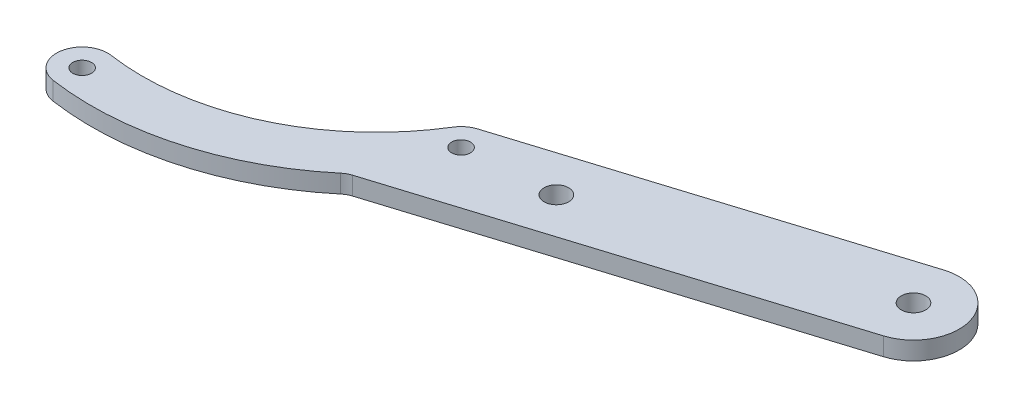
ISO-10303-21;
HEADER;
FILE_DESCRIPTION(('STEP AP214'),'2;1');
FILE_NAME('part.step','',(''),(''),'','','');
FILE_SCHEMA(('AUTOMOTIVE_DESIGN { 1 0 10303 214 1 1 1 1 }'));
ENDSEC;
DATA;
#1=APPLICATION_CONTEXT('core data for automotive mechanical design processes');
#2=APPLICATION_PROTOCOL_DEFINITION('international standard','automotive_design',2000,#1);
#3=PRODUCT_CONTEXT('',#1,'mechanical');
#4=PRODUCT('Part','Part','',(#3));
#5=PRODUCT_RELATED_PRODUCT_CATEGORY('part','',(#4));
#6=PRODUCT_DEFINITION_FORMATION('','',#4);
#7=PRODUCT_DEFINITION_CONTEXT('part definition',#1,'design');
#8=PRODUCT_DEFINITION('design','',#6,#7);
#9=PRODUCT_DEFINITION_SHAPE('','',#8);
#10=(LENGTH_UNIT() NAMED_UNIT(*) SI_UNIT(.MILLI.,.METRE.));
#11=(NAMED_UNIT(*) PLANE_ANGLE_UNIT() SI_UNIT($,.RADIAN.));
#12=(NAMED_UNIT(*) SI_UNIT($,.STERADIAN.) SOLID_ANGLE_UNIT());
#13=UNCERTAINTY_MEASURE_WITH_UNIT(LENGTH_MEASURE(1.E-05),#10,'distance_accuracy_value','');
#14=(GEOMETRIC_REPRESENTATION_CONTEXT(3) GLOBAL_UNCERTAINTY_ASSIGNED_CONTEXT((#13)) GLOBAL_UNIT_ASSIGNED_CONTEXT((#10,
#11,#12)) REPRESENTATION_CONTEXT('',''));
#15=CARTESIAN_POINT('',(0.,0.,0.));
#16=DIRECTION('',(0.,0.,1.));
#17=DIRECTION('',(1.,0.,0.));
#18=AXIS2_PLACEMENT_3D('',#15,#16,#17);
#19=CARTESIAN_POINT('',(-25.0100533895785,0.,7.80623016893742));
#20=DIRECTION('',(0.,-1.,0.));
#21=DIRECTION('',(0.,0.,-1.));
#22=AXIS2_PLACEMENT_3D('',#19,#20,#21);
#23=CYLINDRICAL_SURFACE('',#22,7.99999999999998);
#24=DIRECTION('',(0.,1.,0.));
#25=VECTOR('',#24,1.);
#26=CARTESIAN_POINT('',(-22.6264716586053,0.,15.4428876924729));
#27=LINE('',#26,#25);
#28=CARTESIAN_POINT('',(-22.6264716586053,0.,15.4428876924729));
#29=VERTEX_POINT('',#28);
#30=CARTESIAN_POINT('',(-22.6264716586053,3.175,15.4428876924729));
#31=VERTEX_POINT('',#30);
#32=EDGE_CURVE('E134',#29,#31,#27,.T.);
#33=ORIENTED_EDGE('',*,*,#32,.F.);
#34=CARTESIAN_POINT('',(-25.0100533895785,0.,7.80623016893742));
#35=DIRECTION('',(0.,1.,0.));
#36=DIRECTION('',(0.,0.,1.));
#37=AXIS2_PLACEMENT_3D('',#34,#35,#36);
#38=CIRCLE('',#37,7.99999999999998);
#39=CARTESIAN_POINT('',(-27.3936351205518,0.,0.169572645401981));
#40=VERTEX_POINT('',#39);
#41=EDGE_CURVE('E54',#40,#29,#38,.F.);
#42=ORIENTED_EDGE('',*,*,#41,.F.);
#43=DIRECTION('',(0.,-1.,0.));
#44=VECTOR('',#43,1.);
#45=CARTESIAN_POINT('',(-27.3936351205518,3.175,0.169572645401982));
#46=LINE('',#45,#44);
#47=CARTESIAN_POINT('',(-27.3936351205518,3.175,0.169572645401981));
#48=VERTEX_POINT('',#47);
#49=EDGE_CURVE('E137',#48,#40,#46,.T.);
#50=ORIENTED_EDGE('',*,*,#49,.F.);
#51=CARTESIAN_POINT('',(-25.0100533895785,3.175,7.80623016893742));
#52=DIRECTION('',(0.,1.,0.));
#53=DIRECTION('',(0.,0.,1.));
#54=AXIS2_PLACEMENT_3D('',#51,#52,#53);
#55=CIRCLE('',#54,7.99999999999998);
#56=EDGE_CURVE('E11',#31,#48,#55,.T.);
#57=ORIENTED_EDGE('',*,*,#56,.F.);
#58=EDGE_LOOP('',(#33,#42,#50,#57));
#59=FACE_BOUND('',#58,.T.);
#60=ADVANCED_FACE('F46',(#59),#23,.T.);
#61=CARTESIAN_POINT('',(-127.,3.175,0.));
#62=DIRECTION('',(0.,-1.,0.));
#63=DIRECTION('',(0.,0.,-1.));
#64=AXIS2_PLACEMENT_3D('',#61,#62,#63);
#65=CYLINDRICAL_SURFACE('',#64,49.9725233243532);
#66=CARTESIAN_POINT('',(-127.,0.,0.));
#67=DIRECTION('',(0.,1.,0.));
#68=DIRECTION('',(0.,0.,1.));
#69=AXIS2_PLACEMENT_3D('',#66,#67,#68);
#70=CIRCLE('',#69,49.9725233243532);
#71=CARTESIAN_POINT('',(-134.248974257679,0.,49.4439628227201));
#72=VERTEX_POINT('',#71);
#73=CARTESIAN_POINT('',(-94.9431782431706,0.,38.3355352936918));
#74=VERTEX_POINT('',#73);
#75=EDGE_CURVE('E133',#72,#74,#70,.T.);
#76=ORIENTED_EDGE('',*,*,#75,.T.);
#77=DIRECTION('',(0.,-1.,0.));
#78=VECTOR('',#77,1.);
#79=CARTESIAN_POINT('',(-94.9431782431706,3.175,38.3355352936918));
#80=LINE('',#79,#78);
#81=CARTESIAN_POINT('',(-94.9431782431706,3.175,38.3355352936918));
#82=VERTEX_POINT('',#81);
#83=EDGE_CURVE('E113',#82,#74,#80,.T.);
#84=ORIENTED_EDGE('',*,*,#83,.F.);
#85=CARTESIAN_POINT('',(-127.,3.175,0.));
#86=DIRECTION('',(0.,1.,0.));
#87=DIRECTION('',(0.,0.,1.));
#88=AXIS2_PLACEMENT_3D('',#85,#86,#87);
#89=CIRCLE('',#88,49.9725233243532);
#90=CARTESIAN_POINT('',(-134.248974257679,3.175,49.4439628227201));
#91=VERTEX_POINT('',#90);
#92=EDGE_CURVE('E119',#91,#82,#89,.T.);
#93=ORIENTED_EDGE('',*,*,#92,.F.);
#94=DIRECTION('',(0.,-1.,0.));
#95=VECTOR('',#94,1.);
#96=CARTESIAN_POINT('',(-134.248974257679,3.175,49.4439628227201));
#97=LINE('',#96,#95);
#98=EDGE_CURVE('E167',#91,#72,#97,.T.);
#99=ORIENTED_EDGE('',*,*,#98,.T.);
#100=EDGE_LOOP('',(#76,#84,#93,#99));
#101=FACE_BOUND('',#100,.T.);
#102=ADVANCED_FACE('F131',(#101),#65,.T.);
#103=CARTESIAN_POINT('',(-92.3772224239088,3.175,41.4040643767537));
#104=DIRECTION('',(0.,-1.,0.));
#105=DIRECTION('',(0.,0.,-1.));
#106=AXIS2_PLACEMENT_3D('',#103,#104,#105);
#107=CYLINDRICAL_SURFACE('',#106,3.99999999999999);
#108=CARTESIAN_POINT('',(-92.3772224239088,0.,41.4040643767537));
#109=DIRECTION('',(0.,1.,0.));
#110=DIRECTION('',(0.,0.,1.));
#111=AXIS2_PLACEMENT_3D('',#108,#109,#110);
#112=CIRCLE('',#111,3.99999999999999);
#113=CARTESIAN_POINT('',(-93.5690132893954,0.,37.585735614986));
#114=VERTEX_POINT('',#113);
#115=EDGE_CURVE('E154',#74,#114,#112,.F.);
#116=ORIENTED_EDGE('',*,*,#115,.T.);
#117=DIRECTION('',(0.,-1.,0.));
#118=VECTOR('',#117,1.);
#119=CARTESIAN_POINT('',(-93.5690132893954,3.175,37.585735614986));
#120=LINE('',#119,#118);
#121=CARTESIAN_POINT('',(-93.5690132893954,3.175,37.585735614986));
#122=VERTEX_POINT('',#121);
#123=EDGE_CURVE('E116',#122,#114,#120,.T.);
#124=ORIENTED_EDGE('',*,*,#123,.F.);
#125=CARTESIAN_POINT('',(-92.3772224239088,3.175,41.4040643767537));
#126=DIRECTION('',(0.,1.,0.));
#127=DIRECTION('',(0.,0.,1.));
#128=AXIS2_PLACEMENT_3D('',#125,#126,#127);
#129=CIRCLE('',#128,3.99999999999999);
#130=EDGE_CURVE('E109',#82,#122,#129,.F.);
#131=ORIENTED_EDGE('',*,*,#130,.F.);
#132=ORIENTED_EDGE('',*,*,#83,.T.);
#133=EDGE_LOOP('',(#116,#124,#131,#132));
#134=FACE_BOUND('',#133,.T.);
#135=ADVANCED_FACE('F111',(#134),#107,.F.);
#136=CARTESIAN_POINT('',(2.38358173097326,3.175,7.63665752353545));
#137=DIRECTION('',(-0.297947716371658,0.,-0.954582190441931));
#138=DIRECTION('',(-0.954582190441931,0.,0.297947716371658));
#139=AXIS2_PLACEMENT_3D('',#136,#137,#138);
#140=PLANE('',#139);
#141=DIRECTION('',(0.954582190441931,0.,-0.297947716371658));
#142=VECTOR('',#141,1.);
#143=CARTESIAN_POINT('',(2.38358173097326,0.,7.63665752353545));
#144=LINE('',#143,#142);
#145=EDGE_CURVE('E148',#114,#29,#144,.T.);
#146=ORIENTED_EDGE('',*,*,#145,.T.);
#147=ORIENTED_EDGE('',*,*,#32,.T.);
#148=DIRECTION('',(0.954582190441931,0.,-0.297947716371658));
#149=VECTOR('',#148,1.);
#150=CARTESIAN_POINT('',(2.38358173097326,3.175,7.63665752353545));
#151=LINE('',#150,#149);
#152=EDGE_CURVE('E118',#122,#31,#151,.T.);
#153=ORIENTED_EDGE('',*,*,#152,.F.);
#154=ORIENTED_EDGE('',*,*,#123,.T.);
#155=EDGE_LOOP('',(#146,#147,#153,#154));
#156=FACE_BOUND('',#155,.T.);
#157=ADVANCED_FACE('F153',(#156),#140,.F.);
#158=CARTESIAN_POINT('',(-2.38358173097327,3.175,-7.63665752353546));
#159=DIRECTION('',(-0.297947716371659,0.,-0.95458219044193));
#160=DIRECTION('',(-0.95458219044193,0.,0.297947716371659));
#161=AXIS2_PLACEMENT_3D('',#158,#159,#160);
#162=PLANE('',#161);
#163=DIRECTION('',(0.95458219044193,0.,-0.297947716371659));
#164=VECTOR('',#163,1.);
#165=CARTESIAN_POINT('',(-2.38358173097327,3.175,-7.63665752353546));
#166=LINE('',#165,#164);
#167=CARTESIAN_POINT('',(-89.6194827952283,3.175,19.5917338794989));
#168=VERTEX_POINT('',#167);
#169=EDGE_CURVE('E182',#168,#48,#166,.T.);
#170=ORIENTED_EDGE('',*,*,#169,.T.);
#171=ORIENTED_EDGE('',*,*,#49,.T.);
#172=DIRECTION('',(0.95458219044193,0.,-0.297947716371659));
#173=VECTOR('',#172,1.);
#174=CARTESIAN_POINT('',(-2.38358173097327,0.,-7.63665752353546));
#175=LINE('',#174,#173);
#176=CARTESIAN_POINT('',(-89.6194827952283,0.,19.5917338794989));
#177=VERTEX_POINT('',#176);
#178=EDGE_CURVE('E151',#177,#40,#175,.T.);
#179=ORIENTED_EDGE('',*,*,#178,.F.);
#180=DIRECTION('',(0.,-1.,0.));
#181=VECTOR('',#180,1.);
#182=CARTESIAN_POINT('',(-89.6194827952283,3.175,19.5917338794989));
#183=LINE('',#182,#181);
#184=EDGE_CURVE('E139',#168,#177,#183,.T.);
#185=ORIENTED_EDGE('',*,*,#184,.F.);
#186=EDGE_LOOP('',(#170,#171,#179,#185));
#187=FACE_BOUND('',#186,.T.);
#188=ADVANCED_FACE('F181',(#187),#162,.T.);
#189=CARTESIAN_POINT('',(-88.2828113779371,3.175,23.8742393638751));
#190=DIRECTION('',(0.,-1.,0.));
#191=DIRECTION('',(0.,0.,-1.));
#192=AXIS2_PLACEMENT_3D('',#189,#190,#191);
#193=CYLINDRICAL_SURFACE('',#192,4.48626166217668);
#194=CARTESIAN_POINT('',(-88.2828113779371,0.,23.8742393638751));
#195=DIRECTION('',(0.,1.,0.));
#196=DIRECTION('',(0.,0.,1.));
#197=AXIS2_PLACEMENT_3D('',#194,#195,#196);
#198=CIRCLE('',#197,4.48626166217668);
#199=CARTESIAN_POINT('',(-92.1014465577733,0.,21.5195484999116));
#200=VERTEX_POINT('',#199);
#201=EDGE_CURVE('E156',#177,#200,#198,.T.);
#202=ORIENTED_EDGE('',*,*,#201,.T.);
#203=DIRECTION('',(0.,-1.,0.));
#204=VECTOR('',#203,1.);
#205=CARTESIAN_POINT('',(-92.1014465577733,3.175,21.5195484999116));
#206=LINE('',#205,#204);
#207=CARTESIAN_POINT('',(-92.1014465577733,3.175,21.5195484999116));
#208=VERTEX_POINT('',#207);
#209=EDGE_CURVE('E171',#208,#200,#206,.T.);
#210=ORIENTED_EDGE('',*,*,#209,.F.);
#211=CARTESIAN_POINT('',(-88.2828113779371,3.175,23.8742393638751));
#212=DIRECTION('',(0.,1.,0.));
#213=DIRECTION('',(0.,0.,1.));
#214=AXIS2_PLACEMENT_3D('',#211,#212,#213);
#215=CIRCLE('',#214,4.48626166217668);
#216=EDGE_CURVE('E176',#168,#208,#215,.T.);
#217=ORIENTED_EDGE('',*,*,#216,.F.);
#218=ORIENTED_EDGE('',*,*,#184,.T.);
#219=EDGE_LOOP('',(#202,#210,#217,#218));
#220=FACE_BOUND('',#219,.T.);
#221=ADVANCED_FACE('F174',(#220),#193,.T.);
#222=CARTESIAN_POINT('',(-127.,3.175,0.));
#223=DIRECTION('',(0.,-1.,0.));
#224=DIRECTION('',(0.,0.,-1.));
#225=AXIS2_PLACEMENT_3D('',#222,#223,#224);
#226=CYLINDRICAL_SURFACE('',#225,41.);
#227=CARTESIAN_POINT('',(-127.,0.,0.));
#228=DIRECTION('',(0.,1.,0.));
#229=DIRECTION('',(0.,0.,1.));
#230=AXIS2_PLACEMENT_3D('',#227,#228,#229);
#231=CIRCLE('',#230,41.);
#232=CARTESIAN_POINT('',(-132.94742720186,0.,40.5663420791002));
#233=VERTEX_POINT('',#232);
#234=EDGE_CURVE('E163',#233,#200,#231,.T.);
#235=ORIENTED_EDGE('',*,*,#234,.F.);
#236=DIRECTION('',(0.,-1.,0.));
#237=VECTOR('',#236,1.);
#238=CARTESIAN_POINT('',(-132.94742720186,3.175,40.5663420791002));
#239=LINE('',#238,#237);
#240=CARTESIAN_POINT('',(-132.94742720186,3.175,40.5663420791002));
#241=VERTEX_POINT('',#240);
#242=EDGE_CURVE('E169',#241,#233,#239,.T.);
#243=ORIENTED_EDGE('',*,*,#242,.F.);
#244=CARTESIAN_POINT('',(-127.,3.175,0.));
#245=DIRECTION('',(0.,1.,0.));
#246=DIRECTION('',(0.,0.,1.));
#247=AXIS2_PLACEMENT_3D('',#244,#245,#246);
#248=CIRCLE('',#247,41.);
#249=EDGE_CURVE('E184',#241,#208,#248,.T.);
#250=ORIENTED_EDGE('',*,*,#249,.T.);
#251=ORIENTED_EDGE('',*,*,#209,.T.);
#252=EDGE_LOOP('',(#235,#243,#250,#251));
#253=FACE_BOUND('',#252,.T.);
#254=ADVANCED_FACE('F262',(#253),#226,.F.);
#255=CARTESIAN_POINT('',(-133.59820072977,3.175,45.0051524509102));
#256=DIRECTION('',(0.,-1.,0.));
#257=DIRECTION('',(0.,0.,-1.));
#258=AXIS2_PLACEMENT_3D('',#255,#256,#257);
#259=CYLINDRICAL_SURFACE('',#258,4.48626166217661);
#260=CARTESIAN_POINT('',(-133.59820072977,0.,45.0051524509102));
#261=DIRECTION('',(0.,1.,0.));
#262=DIRECTION('',(0.,0.,1.));
#263=AXIS2_PLACEMENT_3D('',#260,#261,#262);
#264=CIRCLE('',#263,4.48626166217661);
#265=EDGE_CURVE('E129',#233,#72,#264,.T.);
#266=ORIENTED_EDGE('',*,*,#265,.T.);
#267=ORIENTED_EDGE('',*,*,#98,.F.);
#268=CARTESIAN_POINT('',(-133.59820072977,3.175,45.0051524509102));
#269=DIRECTION('',(0.,1.,0.));
#270=DIRECTION('',(0.,0.,1.));
#271=AXIS2_PLACEMENT_3D('',#268,#269,#270);
#272=CIRCLE('',#271,4.48626166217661);
#273=EDGE_CURVE('E125',#241,#91,#272,.T.);
#274=ORIENTED_EDGE('',*,*,#273,.F.);
#275=ORIENTED_EDGE('',*,*,#242,.T.);
#276=EDGE_LOOP('',(#266,#267,#274,#275));
#277=FACE_BOUND('',#276,.T.);
#278=ADVANCED_FACE('F237',(#277),#259,.T.);
#279=CARTESIAN_POINT('',(0.,3.175,0.));
#280=DIRECTION('',(0.,1.,0.));
#281=DIRECTION('',(0.,0.,1.));
#282=AXIS2_PLACEMENT_3D('',#279,#280,#281);
#283=PLANE('',#282);
#284=CARTESIAN_POINT('',(-25.0100533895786,3.175,7.80623016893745));
#285=DIRECTION('',(0.,-1.,0.));
#286=DIRECTION('',(0.,0.,-1.));
#287=AXIS2_PLACEMENT_3D('',#284,#285,#286);
#288=CIRCLE('',#287,2.15);
#289=CARTESIAN_POINT('',(-25.0100533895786,3.175,5.65623016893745));
#290=VERTEX_POINT('',#289);
#291=EDGE_CURVE('E211',#290,#290,#288,.T.);
#292=ORIENTED_EDGE('',*,*,#291,.T.);
#293=EDGE_LOOP('',(#292));
#294=FACE_BOUND('',#293,.T.);
#295=CARTESIAN_POINT('',(-72.7391629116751,3.175,22.7036159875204));
#296=DIRECTION('',(0.,-1.,0.));
#297=DIRECTION('',(0.,0.,-1.));
#298=AXIS2_PLACEMENT_3D('',#295,#296,#297);
#299=CIRCLE('',#298,2.15);
#300=CARTESIAN_POINT('',(-72.7391629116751,3.175,20.5536159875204));
#301=VERTEX_POINT('',#300);
#302=EDGE_CURVE('E205',#301,#301,#299,.T.);
#303=ORIENTED_EDGE('',*,*,#302,.T.);
#304=EDGE_LOOP('',(#303));
#305=FACE_BOUND('',#304,.T.);
#306=CARTESIAN_POINT('',(-133.59820072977,3.175,45.0051524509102));
#307=DIRECTION('',(0.,1.,0.));
#308=DIRECTION('',(0.,0.,1.));
#309=AXIS2_PLACEMENT_3D('',#306,#307,#308);
#310=CIRCLE('',#309,1.65000000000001);
#311=CARTESIAN_POINT('',(-133.59820072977,3.175,46.6551524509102));
#312=VERTEX_POINT('',#311);
#313=EDGE_CURVE('E202',#312,#312,#310,.T.);
#314=ORIENTED_EDGE('',*,*,#313,.F.);
#315=EDGE_LOOP('',(#314));
#316=FACE_BOUND('',#315,.T.);
#317=CARTESIAN_POINT('',(-88.2828113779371,3.175,23.8742393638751));
#318=DIRECTION('',(0.,1.,0.));
#319=DIRECTION('',(0.,0.,1.));
#320=AXIS2_PLACEMENT_3D('',#317,#318,#319);
#321=CIRCLE('',#320,1.65);
#322=CARTESIAN_POINT('',(-88.2828113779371,3.175,25.5242393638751));
#323=VERTEX_POINT('',#322);
#324=EDGE_CURVE('E192',#323,#323,#321,.T.);
#325=ORIENTED_EDGE('',*,*,#324,.F.);
#326=EDGE_LOOP('',(#325));
#327=FACE_BOUND('',#326,.T.);
#328=ORIENTED_EDGE('',*,*,#152,.T.);
#329=ORIENTED_EDGE('',*,*,#56,.T.);
#330=ORIENTED_EDGE('',*,*,#169,.F.);
#331=ORIENTED_EDGE('',*,*,#216,.T.);
#332=ORIENTED_EDGE('',*,*,#249,.F.);
#333=ORIENTED_EDGE('',*,*,#273,.T.);
#334=ORIENTED_EDGE('',*,*,#92,.T.);
#335=ORIENTED_EDGE('',*,*,#130,.T.);
#336=EDGE_LOOP('',(#328,#329,#330,#331,#332,#333,#334,#335));
#337=FACE_BOUND('',#336,.T.);
#338=ADVANCED_FACE('F122',(#294,#305,#316,#327,#337),#283,.T.);
#339=CARTESIAN_POINT('',(0.,0.,0.));
#340=DIRECTION('',(0.,1.,0.));
#341=DIRECTION('',(0.,0.,1.));
#342=AXIS2_PLACEMENT_3D('',#339,#340,#341);
#343=PLANE('',#342);
#344=CARTESIAN_POINT('',(-25.0100533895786,0.,7.80623016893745));
#345=DIRECTION('',(0.,-1.,0.));
#346=DIRECTION('',(0.,0.,-1.));
#347=AXIS2_PLACEMENT_3D('',#344,#345,#346);
#348=CIRCLE('',#347,2.15);
#349=CARTESIAN_POINT('',(-25.0100533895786,0.,5.65623016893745));
#350=VERTEX_POINT('',#349);
#351=EDGE_CURVE('E214',#350,#350,#348,.T.);
#352=ORIENTED_EDGE('',*,*,#351,.F.);
#353=EDGE_LOOP('',(#352));
#354=FACE_BOUND('',#353,.T.);
#355=CARTESIAN_POINT('',(-72.7391629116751,0.,22.7036159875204));
#356=DIRECTION('',(0.,-1.,0.));
#357=DIRECTION('',(0.,0.,-1.));
#358=AXIS2_PLACEMENT_3D('',#355,#356,#357);
#359=CIRCLE('',#358,2.15);
#360=CARTESIAN_POINT('',(-72.7391629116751,0.,20.5536159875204));
#361=VERTEX_POINT('',#360);
#362=EDGE_CURVE('E208',#361,#361,#359,.T.);
#363=ORIENTED_EDGE('',*,*,#362,.F.);
#364=EDGE_LOOP('',(#363));
#365=FACE_BOUND('',#364,.T.);
#366=CARTESIAN_POINT('',(-133.59820072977,0.,45.0051524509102));
#367=DIRECTION('',(0.,1.,0.));
#368=DIRECTION('',(0.,0.,1.));
#369=AXIS2_PLACEMENT_3D('',#366,#367,#368);
#370=CIRCLE('',#369,1.65000000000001);
#371=CARTESIAN_POINT('',(-133.59820072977,0.,46.6551524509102));
#372=VERTEX_POINT('',#371);
#373=EDGE_CURVE('E197',#372,#372,#370,.T.);
#374=ORIENTED_EDGE('',*,*,#373,.T.);
#375=EDGE_LOOP('',(#374));
#376=FACE_BOUND('',#375,.T.);
#377=CARTESIAN_POINT('',(-88.2828113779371,0.,23.8742393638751));
#378=DIRECTION('',(0.,1.,0.));
#379=DIRECTION('',(0.,0.,1.));
#380=AXIS2_PLACEMENT_3D('',#377,#378,#379);
#381=CIRCLE('',#380,1.65);
#382=CARTESIAN_POINT('',(-88.2828113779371,0.,25.5242393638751));
#383=VERTEX_POINT('',#382);
#384=EDGE_CURVE('E190',#383,#383,#381,.T.);
#385=ORIENTED_EDGE('',*,*,#384,.T.);
#386=EDGE_LOOP('',(#385));
#387=FACE_BOUND('',#386,.T.);
#388=ORIENTED_EDGE('',*,*,#178,.T.);
#389=ORIENTED_EDGE('',*,*,#41,.T.);
#390=ORIENTED_EDGE('',*,*,#145,.F.);
#391=ORIENTED_EDGE('',*,*,#115,.F.);
#392=ORIENTED_EDGE('',*,*,#75,.F.);
#393=ORIENTED_EDGE('',*,*,#265,.F.);
#394=ORIENTED_EDGE('',*,*,#234,.T.);
#395=ORIENTED_EDGE('',*,*,#201,.F.);
#396=EDGE_LOOP('',(#388,#389,#390,#391,#392,#393,#394,#395));
#397=FACE_BOUND('',#396,.T.);
#398=ADVANCED_FACE('F146',(#354,#365,#376,#387,#397),#343,.F.);
#399=CARTESIAN_POINT('',(-88.2828113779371,3.175,23.8742393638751));
#400=DIRECTION('',(0.,1.,0.));
#401=DIRECTION('',(0.,0.,1.));
#402=AXIS2_PLACEMENT_3D('',#399,#400,#401);
#403=CYLINDRICAL_SURFACE('',#402,1.65);
#404=ORIENTED_EDGE('',*,*,#384,.F.);
#405=EDGE_LOOP('',(#404));
#406=FACE_BOUND('',#405,.T.);
#407=ORIENTED_EDGE('',*,*,#324,.T.);
#408=EDGE_LOOP('',(#407));
#409=FACE_BOUND('',#408,.T.);
#410=ADVANCED_FACE('F222',(#406,#409),#403,.F.);
#411=CARTESIAN_POINT('',(-133.59820072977,3.175,45.0051524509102));
#412=DIRECTION('',(0.,1.,0.));
#413=DIRECTION('',(0.,0.,1.));
#414=AXIS2_PLACEMENT_3D('',#411,#412,#413);
#415=CYLINDRICAL_SURFACE('',#414,1.65000000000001);
#416=ORIENTED_EDGE('',*,*,#373,.F.);
#417=EDGE_LOOP('',(#416));
#418=FACE_BOUND('',#417,.T.);
#419=ORIENTED_EDGE('',*,*,#313,.T.);
#420=EDGE_LOOP('',(#419));
#421=FACE_BOUND('',#420,.T.);
#422=ADVANCED_FACE('F228',(#418,#421),#415,.F.);
#423=CARTESIAN_POINT('',(-72.7391629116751,0.,22.7036159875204));
#424=DIRECTION('',(0.,-1.,0.));
#425=DIRECTION('',(0.,0.,-1.));
#426=AXIS2_PLACEMENT_3D('',#423,#424,#425);
#427=CYLINDRICAL_SURFACE('',#426,2.15);
#428=ORIENTED_EDGE('',*,*,#302,.F.);
#429=EDGE_LOOP('',(#428));
#430=FACE_BOUND('',#429,.T.);
#431=ORIENTED_EDGE('',*,*,#362,.T.);
#432=EDGE_LOOP('',(#431));
#433=FACE_BOUND('',#432,.T.);
#434=ADVANCED_FACE('F231',(#430,#433),#427,.F.);
#435=CARTESIAN_POINT('',(-25.0100533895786,0.,7.80623016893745));
#436=DIRECTION('',(0.,-1.,0.));
#437=DIRECTION('',(0.,0.,-1.));
#438=AXIS2_PLACEMENT_3D('',#435,#436,#437);
#439=CYLINDRICAL_SURFACE('',#438,2.15);
#440=ORIENTED_EDGE('',*,*,#291,.F.);
#441=EDGE_LOOP('',(#440));
#442=FACE_BOUND('',#441,.T.);
#443=ORIENTED_EDGE('',*,*,#351,.T.);
#444=EDGE_LOOP('',(#443));
#445=FACE_BOUND('',#444,.T.);
#446=ADVANCED_FACE('F218',(#442,#445),#439,.F.);
#447=CLOSED_SHELL('',(#60,#102,#135,#157,#188,#221,#254,#278,#338,#398,#410,#422,#434,#446));
#448=MANIFOLD_SOLID_BREP('B2',#447);
#449=ADVANCED_BREP_SHAPE_REPRESENTATION('',(#18,#448),#14);
#450=SHAPE_DEFINITION_REPRESENTATION(#9,#449);
ENDSEC;
END-ISO-10303-21;
